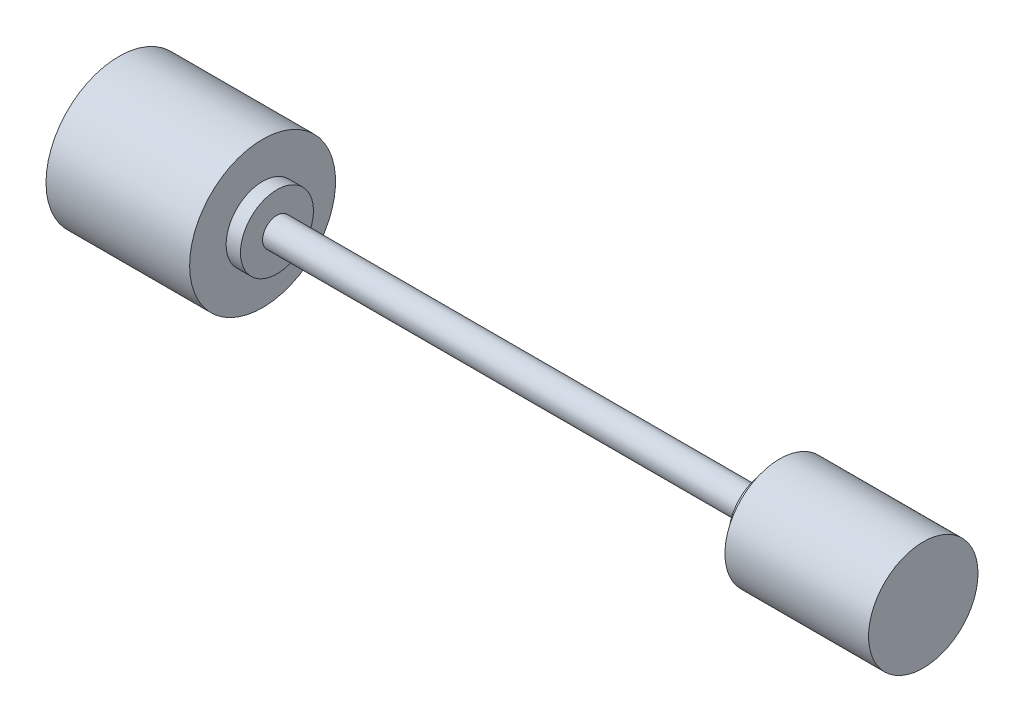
ISO-10303-21;
HEADER;
FILE_DESCRIPTION(('STEP AP214'),'2;1');
FILE_NAME('part.step','',(''),(''),'','','');
FILE_SCHEMA(('AUTOMOTIVE_DESIGN { 1 0 10303 214 1 1 1 1 }'));
ENDSEC;
DATA;
#1=APPLICATION_CONTEXT('core data for automotive mechanical design processes');
#2=APPLICATION_PROTOCOL_DEFINITION('international standard','automotive_design',2000,#1);
#3=PRODUCT_CONTEXT('',#1,'mechanical');
#4=PRODUCT('Part','Part','',(#3));
#5=PRODUCT_RELATED_PRODUCT_CATEGORY('part','',(#4));
#6=PRODUCT_DEFINITION_FORMATION('','',#4);
#7=PRODUCT_DEFINITION_CONTEXT('part definition',#1,'design');
#8=PRODUCT_DEFINITION('design','',#6,#7);
#9=PRODUCT_DEFINITION_SHAPE('','',#8);
#10=(LENGTH_UNIT() NAMED_UNIT(*) SI_UNIT(.MILLI.,.METRE.));
#11=(NAMED_UNIT(*) PLANE_ANGLE_UNIT() SI_UNIT($,.RADIAN.));
#12=(NAMED_UNIT(*) SI_UNIT($,.STERADIAN.) SOLID_ANGLE_UNIT());
#13=UNCERTAINTY_MEASURE_WITH_UNIT(LENGTH_MEASURE(1.E-05),#10,'distance_accuracy_value','');
#14=(GEOMETRIC_REPRESENTATION_CONTEXT(3) GLOBAL_UNCERTAINTY_ASSIGNED_CONTEXT((#13)) GLOBAL_UNIT_ASSIGNED_CONTEXT((#10,
#11,#12)) REPRESENTATION_CONTEXT('',''));
#15=CARTESIAN_POINT('',(0.,0.,0.));
#16=DIRECTION('',(0.,0.,1.));
#17=DIRECTION('',(1.,0.,0.));
#18=AXIS2_PLACEMENT_3D('',#15,#16,#17);
#19=CARTESIAN_POINT('',(340.,0.,0.));
#20=DIRECTION('',(-1.,0.,0.));
#21=DIRECTION('',(0.,0.,1.));
#22=AXIS2_PLACEMENT_3D('',#19,#20,#21);
#23=CYLINDRICAL_SURFACE('',#22,10.);
#24=CARTESIAN_POINT('',(340.,0.,0.));
#25=DIRECTION('',(1.,0.,0.));
#26=DIRECTION('',(0.,0.,-1.));
#27=AXIS2_PLACEMENT_3D('',#24,#25,#26);
#28=CIRCLE('',#27,10.);
#29=CARTESIAN_POINT('',(340.,0.,-10.));
#30=VERTEX_POINT('',#29);
#31=EDGE_CURVE('E10',#30,#30,#28,.T.);
#32=ORIENTED_EDGE('',*,*,#31,.F.);
#33=EDGE_LOOP('',(#32));
#34=FACE_BOUND('',#33,.T.);
#35=CARTESIAN_POINT('',(0.,0.,0.));
#36=DIRECTION('',(-1.,0.,0.));
#37=DIRECTION('',(0.,0.,1.));
#38=AXIS2_PLACEMENT_3D('',#35,#36,#37);
#39=CIRCLE('',#38,10.);
#40=CARTESIAN_POINT('',(0.,0.,10.));
#41=VERTEX_POINT('',#40);
#42=EDGE_CURVE('E46',#41,#41,#39,.T.);
#43=ORIENTED_EDGE('',*,*,#42,.F.);
#44=EDGE_LOOP('',(#43));
#45=FACE_BOUND('',#44,.T.);
#46=ADVANCED_FACE('F24',(#34,#45),#23,.T.);
#47=CARTESIAN_POINT('',(340.,0.,0.));
#48=DIRECTION('',(1.,0.,0.));
#49=DIRECTION('',(0.,0.,-1.));
#50=AXIS2_PLACEMENT_3D('',#47,#48,#49);
#51=PLANE('',#50);
#52=CARTESIAN_POINT('',(340.,0.,0.));
#53=DIRECTION('',(1.,0.,0.));
#54=DIRECTION('',(0.,0.,-1.));
#55=AXIS2_PLACEMENT_3D('',#52,#53,#54);
#56=CIRCLE('',#55,25.4000000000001);
#57=CARTESIAN_POINT('',(340.,0.,-25.4000000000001));
#58=VERTEX_POINT('',#57);
#59=EDGE_CURVE('E34',#58,#58,#56,.T.);
#60=ORIENTED_EDGE('',*,*,#59,.F.);
#61=EDGE_LOOP('',(#60));
#62=FACE_BOUND('',#61,.T.);
#63=ORIENTED_EDGE('',*,*,#31,.T.);
#64=EDGE_LOOP('',(#63));
#65=FACE_BOUND('',#64,.T.);
#66=ADVANCED_FACE('F84',(#62,#65),#51,.F.);
#67=CARTESIAN_POINT('',(350.,0.,0.));
#68=DIRECTION('',(-1.,0.,0.));
#69=DIRECTION('',(0.,0.,1.));
#70=AXIS2_PLACEMENT_3D('',#67,#68,#69);
#71=CYLINDRICAL_SURFACE('',#70,25.4000000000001);
#72=CARTESIAN_POINT('',(350.,0.,0.));
#73=DIRECTION('',(1.,0.,0.));
#74=DIRECTION('',(0.,0.,-1.));
#75=AXIS2_PLACEMENT_3D('',#72,#73,#74);
#76=CIRCLE('',#75,25.4000000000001);
#77=CARTESIAN_POINT('',(350.,0.,-25.4000000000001));
#78=VERTEX_POINT('',#77);
#79=EDGE_CURVE('E30',#78,#78,#76,.T.);
#80=ORIENTED_EDGE('',*,*,#79,.F.);
#81=EDGE_LOOP('',(#80));
#82=FACE_BOUND('',#81,.T.);
#83=ORIENTED_EDGE('',*,*,#59,.T.);
#84=EDGE_LOOP('',(#83));
#85=FACE_BOUND('',#84,.T.);
#86=ADVANCED_FACE('F89',(#82,#85),#71,.T.);
#87=CARTESIAN_POINT('',(350.,0.,0.));
#88=DIRECTION('',(1.,0.,0.));
#89=DIRECTION('',(0.,0.,-1.));
#90=AXIS2_PLACEMENT_3D('',#87,#88,#89);
#91=PLANE('',#90);
#92=CARTESIAN_POINT('',(350.,0.,0.));
#93=DIRECTION('',(1.,0.,0.));
#94=DIRECTION('',(0.,0.,-1.));
#95=AXIS2_PLACEMENT_3D('',#92,#93,#94);
#96=CIRCLE('',#95,38.1);
#97=CARTESIAN_POINT('',(350.,0.,-38.1));
#98=VERTEX_POINT('',#97);
#99=EDGE_CURVE('E43',#98,#98,#96,.T.);
#100=ORIENTED_EDGE('',*,*,#99,.F.);
#101=EDGE_LOOP('',(#100));
#102=FACE_BOUND('',#101,.T.);
#103=ORIENTED_EDGE('',*,*,#79,.T.);
#104=EDGE_LOOP('',(#103));
#105=FACE_BOUND('',#104,.T.);
#106=ADVANCED_FACE('F95',(#102,#105),#91,.F.);
#107=CARTESIAN_POINT('',(450.,0.,0.));
#108=DIRECTION('',(-1.,0.,0.));
#109=DIRECTION('',(0.,0.,1.));
#110=AXIS2_PLACEMENT_3D('',#107,#108,#109);
#111=CYLINDRICAL_SURFACE('',#110,38.1);
#112=CARTESIAN_POINT('',(450.,0.,0.));
#113=DIRECTION('',(1.,0.,0.));
#114=DIRECTION('',(0.,0.,-1.));
#115=AXIS2_PLACEMENT_3D('',#112,#113,#114);
#116=CIRCLE('',#115,38.1);
#117=CARTESIAN_POINT('',(450.,0.,-38.1));
#118=VERTEX_POINT('',#117);
#119=EDGE_CURVE('E38',#118,#118,#116,.T.);
#120=ORIENTED_EDGE('',*,*,#119,.F.);
#121=EDGE_LOOP('',(#120));
#122=FACE_BOUND('',#121,.T.);
#123=ORIENTED_EDGE('',*,*,#99,.T.);
#124=EDGE_LOOP('',(#123));
#125=FACE_BOUND('',#124,.T.);
#126=ADVANCED_FACE('F99',(#122,#125),#111,.T.);
#127=CARTESIAN_POINT('',(450.,0.,0.));
#128=DIRECTION('',(1.,0.,0.));
#129=DIRECTION('',(0.,0.,-1.));
#130=AXIS2_PLACEMENT_3D('',#127,#128,#129);
#131=PLANE('',#130);
#132=ORIENTED_EDGE('',*,*,#119,.T.);
#133=EDGE_LOOP('',(#132));
#134=FACE_BOUND('',#133,.T.);
#135=ADVANCED_FACE('F79',(#134),#131,.T.);
#136=CARTESIAN_POINT('',(0.,0.,0.));
#137=DIRECTION('',(-1.,0.,0.));
#138=DIRECTION('',(0.,0.,1.));
#139=AXIS2_PLACEMENT_3D('',#136,#137,#138);
#140=PLANE('',#139);
#141=CARTESIAN_POINT('',(0.,0.,0.));
#142=DIRECTION('',(-1.,0.,0.));
#143=DIRECTION('',(0.,0.,1.));
#144=AXIS2_PLACEMENT_3D('',#141,#142,#143);
#145=CIRCLE('',#144,25.4000000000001);
#146=CARTESIAN_POINT('',(0.,0.,25.4000000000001));
#147=VERTEX_POINT('',#146);
#148=EDGE_CURVE('E52',#147,#147,#145,.T.);
#149=ORIENTED_EDGE('',*,*,#148,.F.);
#150=EDGE_LOOP('',(#149));
#151=FACE_BOUND('',#150,.T.);
#152=ORIENTED_EDGE('',*,*,#42,.T.);
#153=EDGE_LOOP('',(#152));
#154=FACE_BOUND('',#153,.T.);
#155=ADVANCED_FACE('F73',(#151,#154),#140,.F.);
#156=CARTESIAN_POINT('',(-10.,0.,0.));
#157=DIRECTION('',(1.,0.,0.));
#158=DIRECTION('',(0.,0.,-1.));
#159=AXIS2_PLACEMENT_3D('',#156,#157,#158);
#160=CYLINDRICAL_SURFACE('',#159,25.4000000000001);
#161=CARTESIAN_POINT('',(-10.,0.,0.));
#162=DIRECTION('',(-1.,0.,0.));
#163=DIRECTION('',(0.,0.,1.));
#164=AXIS2_PLACEMENT_3D('',#161,#162,#163);
#165=CIRCLE('',#164,25.4000000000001);
#166=CARTESIAN_POINT('',(-10.,0.,25.4000000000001));
#167=VERTEX_POINT('',#166);
#168=EDGE_CURVE('E49',#167,#167,#165,.T.);
#169=ORIENTED_EDGE('',*,*,#168,.F.);
#170=EDGE_LOOP('',(#169));
#171=FACE_BOUND('',#170,.T.);
#172=ORIENTED_EDGE('',*,*,#148,.T.);
#173=EDGE_LOOP('',(#172));
#174=FACE_BOUND('',#173,.T.);
#175=ADVANCED_FACE('F67',(#171,#174),#160,.T.);
#176=CARTESIAN_POINT('',(-10.,0.,0.));
#177=DIRECTION('',(-1.,0.,0.));
#178=DIRECTION('',(0.,0.,1.));
#179=AXIS2_PLACEMENT_3D('',#176,#177,#178);
#180=PLANE('',#179);
#181=CARTESIAN_POINT('',(-10.,0.,0.));
#182=DIRECTION('',(-1.,0.,0.));
#183=DIRECTION('',(0.,0.,1.));
#184=AXIS2_PLACEMENT_3D('',#181,#182,#183);
#185=CIRCLE('',#184,50.8);
#186=CARTESIAN_POINT('',(-10.,0.,50.8));
#187=VERTEX_POINT('',#186);
#188=EDGE_CURVE('E58',#187,#187,#185,.T.);
#189=ORIENTED_EDGE('',*,*,#188,.F.);
#190=EDGE_LOOP('',(#189));
#191=FACE_BOUND('',#190,.T.);
#192=ORIENTED_EDGE('',*,*,#168,.T.);
#193=EDGE_LOOP('',(#192));
#194=FACE_BOUND('',#193,.T.);
#195=ADVANCED_FACE('F64',(#191,#194),#180,.F.);
#196=CARTESIAN_POINT('',(-110.,0.,0.));
#197=DIRECTION('',(1.,0.,0.));
#198=DIRECTION('',(0.,0.,-1.));
#199=AXIS2_PLACEMENT_3D('',#196,#197,#198);
#200=CYLINDRICAL_SURFACE('',#199,50.8);
#201=CARTESIAN_POINT('',(-110.,0.,0.));
#202=DIRECTION('',(-1.,0.,0.));
#203=DIRECTION('',(0.,0.,1.));
#204=AXIS2_PLACEMENT_3D('',#201,#202,#203);
#205=CIRCLE('',#204,50.8);
#206=CARTESIAN_POINT('',(-110.,0.,50.8));
#207=VERTEX_POINT('',#206);
#208=EDGE_CURVE('E55',#207,#207,#205,.T.);
#209=ORIENTED_EDGE('',*,*,#208,.F.);
#210=EDGE_LOOP('',(#209));
#211=FACE_BOUND('',#210,.T.);
#212=ORIENTED_EDGE('',*,*,#188,.T.);
#213=EDGE_LOOP('',(#212));
#214=FACE_BOUND('',#213,.T.);
#215=ADVANCED_FACE('F62',(#211,#214),#200,.T.);
#216=CARTESIAN_POINT('',(-110.,0.,0.));
#217=DIRECTION('',(-1.,0.,0.));
#218=DIRECTION('',(0.,0.,1.));
#219=AXIS2_PLACEMENT_3D('',#216,#217,#218);
#220=PLANE('',#219);
#221=ORIENTED_EDGE('',*,*,#208,.T.);
#222=EDGE_LOOP('',(#221));
#223=FACE_BOUND('',#222,.T.);
#224=ADVANCED_FACE('F111',(#223),#220,.T.);
#225=CLOSED_SHELL('',(#46,#66,#86,#106,#126,#135,#155,#175,#195,#215,#224));
#226=MANIFOLD_SOLID_BREP('B2',#225);
#227=ADVANCED_BREP_SHAPE_REPRESENTATION('',(#18,#226),#14);
#228=SHAPE_DEFINITION_REPRESENTATION(#9,#227);
ENDSEC;
END-ISO-10303-21;
